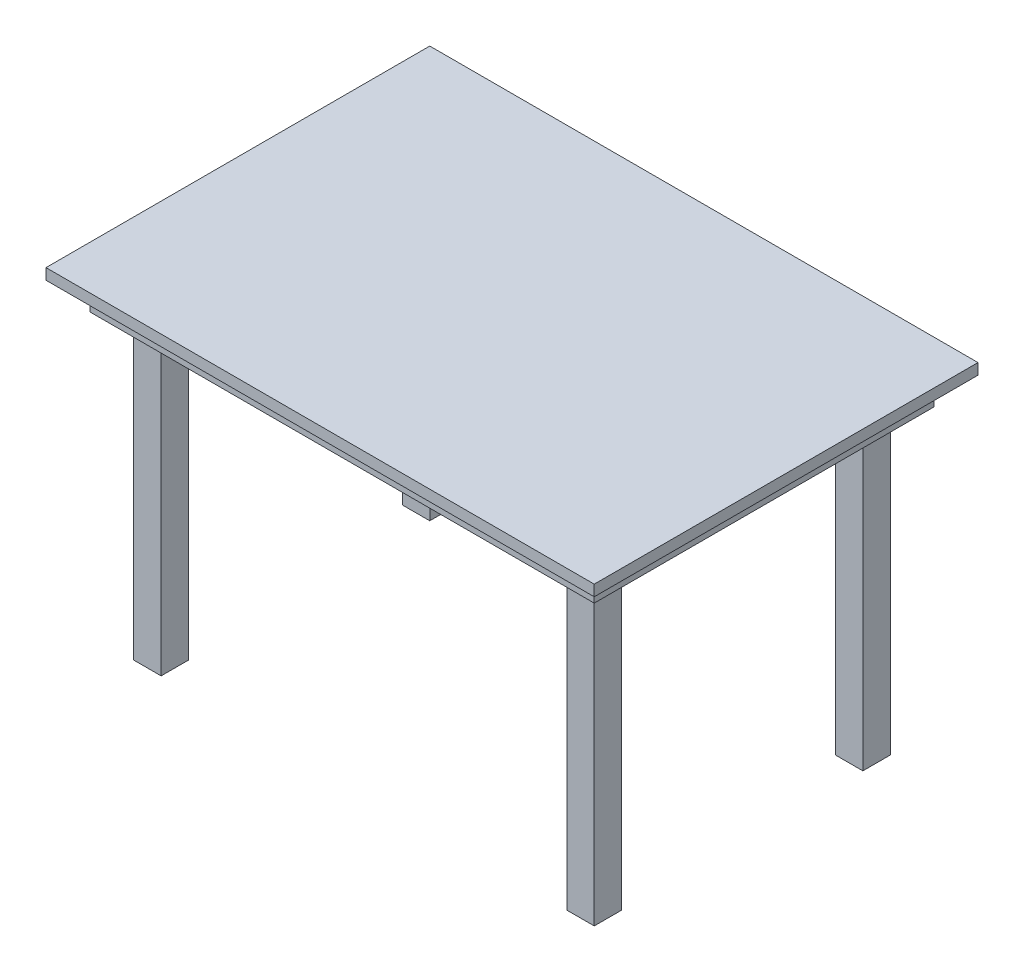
from build123d import *

# Parameters (mm, degrees)
SKETCH1_W           = 1000
SKETCH1_H           = 700
BOSS_EXTRUDE1_DEPTH = 20
SKETCH2_W           = 920
SKETCH2_H           = 620
SKETCH2_W_2         = 840
SKETCH2_H_2         = 540
BOSS_EXTRUDE3_DEPTH = 50
SKETCH3_W           = 50
SKETCH3_H           = 50
BOSS_EXTRUDE4_DEPTH = 600


with BuildPart() as part:
    # Sketch1 → Boss-Extrude1 (new body)
    with BuildSketch(Plane(origin=(0, 0, 0), x_dir=(1, 0, 0), z_dir=(0, 1, 0))):
        with Locations((500, 350)):
            Rectangle(SKETCH1_W, SKETCH1_H)
    extrude(amount=BOSS_EXTRUDE1_DEPTH)

    # Sketch2 → Boss-Extrude3 (add)
    with BuildSketch(Plane.XZ):
        with Locations((500, -350)):
            Rectangle(SKETCH2_W, SKETCH2_H)
        with Locations((500, -350)):
            Rectangle(SKETCH2_W_2, SKETCH2_H_2, mode=Mode.SUBTRACT)
    extrude(amount=BOSS_EXTRUDE3_DEPTH)

    # Sketch3 → Boss-Extrude4 (add)
    with BuildSketch(Plane.XZ):
        with Locations((105, -105)):
            Rectangle(SKETCH3_W, SKETCH3_H)
        with Locations((895, -105)):
            Rectangle(SKETCH3_W, SKETCH3_H)
        with Locations((895, -595)):
            Rectangle(SKETCH3_W, SKETCH3_H)
        with Locations((105, -595)):
            Rectangle(SKETCH3_W, SKETCH3_H)
    extrude(amount=BOSS_EXTRUDE4_DEPTH)


solid = part.part
